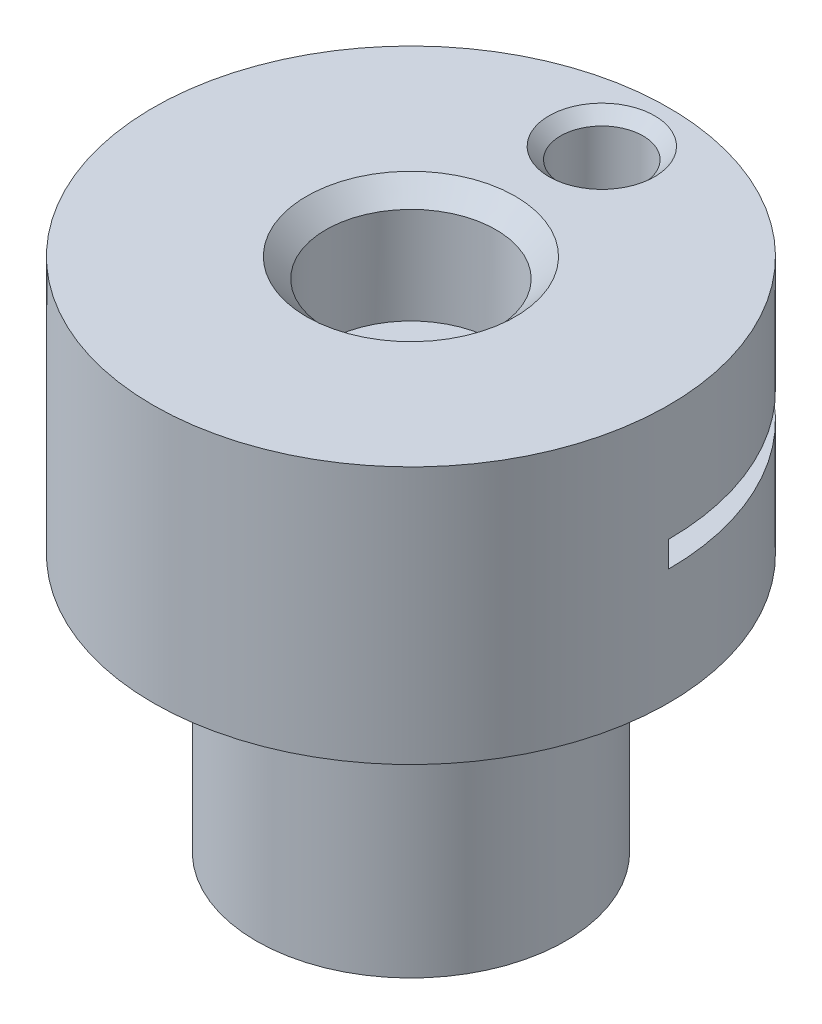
ISO-10303-21;
HEADER;
FILE_DESCRIPTION(('STEP AP214'),'2;1');
FILE_NAME('part.step','',(''),(''),'','','');
FILE_SCHEMA(('AUTOMOTIVE_DESIGN { 1 0 10303 214 1 1 1 1 }'));
ENDSEC;
DATA;
#1=APPLICATION_CONTEXT('core data for automotive mechanical design processes');
#2=APPLICATION_PROTOCOL_DEFINITION('international standard','automotive_design',2000,#1);
#3=PRODUCT_CONTEXT('',#1,'mechanical');
#4=PRODUCT('Part','Part','',(#3));
#5=PRODUCT_RELATED_PRODUCT_CATEGORY('part','',(#4));
#6=PRODUCT_DEFINITION_FORMATION('','',#4);
#7=PRODUCT_DEFINITION_CONTEXT('part definition',#1,'design');
#8=PRODUCT_DEFINITION('design','',#6,#7);
#9=PRODUCT_DEFINITION_SHAPE('','',#8);
#10=(LENGTH_UNIT() NAMED_UNIT(*) SI_UNIT(.MILLI.,.METRE.));
#11=(NAMED_UNIT(*) PLANE_ANGLE_UNIT() SI_UNIT($,.RADIAN.));
#12=(NAMED_UNIT(*) SI_UNIT($,.STERADIAN.) SOLID_ANGLE_UNIT());
#13=UNCERTAINTY_MEASURE_WITH_UNIT(LENGTH_MEASURE(1.E-05),#10,'distance_accuracy_value','');
#14=(GEOMETRIC_REPRESENTATION_CONTEXT(3) GLOBAL_UNCERTAINTY_ASSIGNED_CONTEXT((#13)) GLOBAL_UNIT_ASSIGNED_CONTEXT((#10,
#11,#12)) REPRESENTATION_CONTEXT('',''));
#15=CARTESIAN_POINT('',(0.,0.,0.));
#16=DIRECTION('',(0.,0.,1.));
#17=DIRECTION('',(1.,0.,0.));
#18=AXIS2_PLACEMENT_3D('',#15,#16,#17);
#19=CARTESIAN_POINT('',(0.000112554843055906,10.,-3.70259777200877));
#20=DIRECTION('',(0.,1.,0.));
#21=DIRECTION('',(0.,0.,1.));
#22=AXIS2_PLACEMENT_3D('',#19,#20,#21);
#23=CYLINDRICAL_SURFACE('',#22,0.799999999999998);
#24=CARTESIAN_POINT('',(0.000112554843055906,7.75,-3.70259777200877));
#25=DIRECTION('',(0.,1.,0.));
#26=DIRECTION('',(-1.,0.,0.));
#27=AXIS2_PLACEMENT_3D('',#24,#25,#26);
#28=CIRCLE('',#27,0.799999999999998);
#29=CARTESIAN_POINT('',(-0.799887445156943,7.75,-3.70259777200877));
#30=VERTEX_POINT('',#29);
#31=EDGE_CURVE('E108',#30,#30,#28,.F.);
#32=ORIENTED_EDGE('',*,*,#31,.T.);
#33=EDGE_LOOP('',(#32));
#34=FACE_BOUND('',#33,.T.);
#35=CARTESIAN_POINT('',(0.000112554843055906,9.775,-3.70259777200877));
#36=DIRECTION('',(0.,1.,0.));
#37=DIRECTION('',(0.,0.,1.));
#38=AXIS2_PLACEMENT_3D('',#35,#36,#37);
#39=CIRCLE('',#38,0.799999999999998);
#40=CARTESIAN_POINT('',(0.000112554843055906,9.775,-2.90259777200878));
#41=VERTEX_POINT('',#40);
#42=EDGE_CURVE('E124',#41,#41,#39,.T.);
#43=ORIENTED_EDGE('',*,*,#42,.T.);
#44=EDGE_LOOP('',(#43));
#45=FACE_BOUND('',#44,.T.);
#46=ADVANCED_FACE('F44',(#34,#45),#23,.F.);
#47=CARTESIAN_POINT('',(0.,0.,0.));
#48=DIRECTION('',(0.,-1.,0.));
#49=DIRECTION('',(0.,0.,-1.));
#50=AXIS2_PLACEMENT_3D('',#47,#48,#49);
#51=PLANE('',#50);
#52=CARTESIAN_POINT('',(0.000258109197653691,0.,0.000184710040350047));
#53=DIRECTION('',(0.,1.,0.));
#54=DIRECTION('',(0.,0.,1.));
#55=AXIS2_PLACEMENT_3D('',#52,#53,#54);
#56=CIRCLE('',#55,1.65);
#57=CARTESIAN_POINT('',(0.000258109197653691,0.,1.65018471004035));
#58=VERTEX_POINT('',#57);
#59=EDGE_CURVE('E137',#58,#58,#56,.T.);
#60=ORIENTED_EDGE('',*,*,#59,.T.);
#61=EDGE_LOOP('',(#60));
#62=FACE_BOUND('',#61,.T.);
#63=CARTESIAN_POINT('',(0.,0.,0.));
#64=DIRECTION('',(0.,1.,0.));
#65=DIRECTION('',(0.,0.,1.));
#66=AXIS2_PLACEMENT_3D('',#63,#64,#65);
#67=CIRCLE('',#66,3.);
#68=CARTESIAN_POINT('',(0.,0.,3.));
#69=VERTEX_POINT('',#68);
#70=EDGE_CURVE('E150',#69,#69,#67,.T.);
#71=ORIENTED_EDGE('',*,*,#70,.F.);
#72=EDGE_LOOP('',(#71));
#73=FACE_BOUND('',#72,.T.);
#74=ADVANCED_FACE('F46',(#62,#73),#51,.T.);
#75=CARTESIAN_POINT('',(0.,12.8085871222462,0.));
#76=DIRECTION('',(0.,1.,0.));
#77=DIRECTION('',(0.,0.,1.));
#78=AXIS2_PLACEMENT_3D('',#75,#76,#77);
#79=CYLINDRICAL_SURFACE('',#78,3.);
#80=ORIENTED_EDGE('',*,*,#70,.T.);
#81=EDGE_LOOP('',(#80));
#82=FACE_BOUND('',#81,.T.);
#83=CARTESIAN_POINT('',(0.,5.,0.));
#84=DIRECTION('',(0.,1.,0.));
#85=DIRECTION('',(0.,0.,1.));
#86=AXIS2_PLACEMENT_3D('',#83,#84,#85);
#87=CIRCLE('',#86,3.);
#88=CARTESIAN_POINT('',(0.343883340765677,5.,-2.98022553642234));
#89=VERTEX_POINT('',#88);
#90=CARTESIAN_POINT('',(-0.343702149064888,5.,-2.98024643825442));
#91=VERTEX_POINT('',#90);
#92=EDGE_CURVE('E147',#89,#91,#87,.T.);
#93=ORIENTED_EDGE('',*,*,#92,.F.);
#94=EDGE_CURVE('E146',#91,#89,#87,.T.);
#95=ORIENTED_EDGE('',*,*,#94,.F.);
#96=EDGE_LOOP('',(#93,#95));
#97=FACE_BOUND('',#96,.T.);
#98=ADVANCED_FACE('F177',(#82,#97),#79,.T.);
#99=CARTESIAN_POINT('',(-3.,5.,0.));
#100=DIRECTION('',(0.,-1.,0.));
#101=DIRECTION('',(0.,0.,-1.));
#102=AXIS2_PLACEMENT_3D('',#99,#100,#101);
#103=PLANE('',#102);
#104=CARTESIAN_POINT('',(0.000112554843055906,5.,-3.70259777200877));
#105=DIRECTION('',(0.,-1.,0.));
#106=DIRECTION('',(0.,0.,-1.));
#107=AXIS2_PLACEMENT_3D('',#104,#105,#106);
#108=CIRCLE('',#107,0.799999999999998);
#109=EDGE_CURVE('E92',#91,#89,#108,.T.);
#110=ORIENTED_EDGE('',*,*,#109,.F.);
#111=ORIENTED_EDGE('',*,*,#94,.T.);
#112=EDGE_LOOP('',(#110,#111));
#113=FACE_BOUND('',#112,.T.);
#114=CARTESIAN_POINT('',(0.,5.,0.));
#115=DIRECTION('',(0.,1.,0.));
#116=DIRECTION('',(0.,0.,1.));
#117=AXIS2_PLACEMENT_3D('',#114,#115,#116);
#118=CIRCLE('',#117,5.);
#119=CARTESIAN_POINT('',(0.,5.,5.));
#120=VERTEX_POINT('',#119);
#121=EDGE_CURVE('E143',#120,#120,#118,.T.);
#122=ORIENTED_EDGE('',*,*,#121,.F.);
#123=EDGE_LOOP('',(#122));
#124=FACE_BOUND('',#123,.T.);
#125=ADVANCED_FACE('F200',(#113,#124),#103,.T.);
#126=CARTESIAN_POINT('',(0.,12.8085871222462,0.));
#127=DIRECTION('',(0.,1.,0.));
#128=DIRECTION('',(0.,0.,1.));
#129=AXIS2_PLACEMENT_3D('',#126,#127,#128);
#130=CYLINDRICAL_SURFACE('',#129,5.);
#131=DIRECTION('',(0.,1.,0.));
#132=VECTOR('',#131,1.);
#133=CARTESIAN_POINT('',(5.,12.8085871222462,0.));
#134=LINE('',#133,#132);
#135=CARTESIAN_POINT('',(5.,7.75,0.));
#136=VERTEX_POINT('',#135);
#137=CARTESIAN_POINT('',(5.,7.25,0.));
#138=VERTEX_POINT('',#137);
#139=EDGE_CURVE('E121',#136,#138,#134,.F.);
#140=ORIENTED_EDGE('',*,*,#139,.F.);
#141=CARTESIAN_POINT('',(0.,7.75,0.));
#142=DIRECTION('',(0.,1.,0.));
#143=DIRECTION('',(-1.,0.,0.));
#144=AXIS2_PLACEMENT_3D('',#141,#142,#143);
#145=CIRCLE('',#144,5.);
#146=CARTESIAN_POINT('',(-5.,7.75,0.));
#147=VERTEX_POINT('',#146);
#148=EDGE_CURVE('E117',#147,#136,#145,.F.);
#149=ORIENTED_EDGE('',*,*,#148,.F.);
#150=DIRECTION('',(0.,1.,0.));
#151=VECTOR('',#150,1.);
#152=CARTESIAN_POINT('',(-5.,12.8085871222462,0.));
#153=LINE('',#152,#151);
#154=CARTESIAN_POINT('',(-5.,7.25,0.));
#155=VERTEX_POINT('',#154);
#156=EDGE_CURVE('E119',#155,#147,#153,.T.);
#157=ORIENTED_EDGE('',*,*,#156,.F.);
#158=CARTESIAN_POINT('',(0.,7.25,0.));
#159=DIRECTION('',(0.,-1.,0.));
#160=DIRECTION('',(1.,0.,0.));
#161=AXIS2_PLACEMENT_3D('',#158,#159,#160);
#162=CIRCLE('',#161,5.);
#163=EDGE_CURVE('E100',#138,#155,#162,.F.);
#164=ORIENTED_EDGE('',*,*,#163,.F.);
#165=EDGE_LOOP('',(#140,#149,#157,#164));
#166=FACE_BOUND('',#165,.T.);
#167=ORIENTED_EDGE('',*,*,#121,.T.);
#168=EDGE_LOOP('',(#167));
#169=FACE_BOUND('',#168,.T.);
#170=CARTESIAN_POINT('',(0.,10.,0.));
#171=DIRECTION('',(0.,1.,0.));
#172=DIRECTION('',(0.,0.,1.));
#173=AXIS2_PLACEMENT_3D('',#170,#171,#172);
#174=CIRCLE('',#173,5.);
#175=CARTESIAN_POINT('',(0.,10.,5.));
#176=VERTEX_POINT('',#175);
#177=EDGE_CURVE('E140',#176,#176,#174,.T.);
#178=ORIENTED_EDGE('',*,*,#177,.F.);
#179=EDGE_LOOP('',(#178));
#180=FACE_BOUND('',#179,.T.);
#181=ADVANCED_FACE('F215',(#166,#169,#180),#130,.T.);
#182=CARTESIAN_POINT('',(-5.,10.,0.));
#183=DIRECTION('',(0.,1.,0.));
#184=DIRECTION('',(0.,0.,1.));
#185=AXIS2_PLACEMENT_3D('',#182,#183,#184);
#186=PLANE('',#185);
#187=CARTESIAN_POINT('',(0.000112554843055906,10.,-3.70259777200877));
#188=DIRECTION('',(0.,1.,0.));
#189=DIRECTION('',(0.,0.,1.));
#190=AXIS2_PLACEMENT_3D('',#187,#188,#189);
#191=CIRCLE('',#190,1.025);
#192=CARTESIAN_POINT('',(0.000112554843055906,10.,-2.67759777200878));
#193=VERTEX_POINT('',#192);
#194=EDGE_CURVE('E128',#193,#193,#191,.T.);
#195=ORIENTED_EDGE('',*,*,#194,.F.);
#196=EDGE_LOOP('',(#195));
#197=FACE_BOUND('',#196,.T.);
#198=CARTESIAN_POINT('',(0.000258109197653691,10.,0.000184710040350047));
#199=DIRECTION('',(0.,1.,0.));
#200=DIRECTION('',(0.,0.,1.));
#201=AXIS2_PLACEMENT_3D('',#198,#199,#200);
#202=CIRCLE('',#201,2.025);
#203=CARTESIAN_POINT('',(0.000258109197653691,10.,2.02518471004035));
#204=VERTEX_POINT('',#203);
#205=EDGE_CURVE('E127',#204,#204,#202,.T.);
#206=ORIENTED_EDGE('',*,*,#205,.F.);
#207=EDGE_LOOP('',(#206));
#208=FACE_BOUND('',#207,.T.);
#209=ORIENTED_EDGE('',*,*,#177,.T.);
#210=EDGE_LOOP('',(#209));
#211=FACE_BOUND('',#210,.T.);
#212=ADVANCED_FACE('F212',(#197,#208,#211),#186,.T.);
#213=CARTESIAN_POINT('',(0.000258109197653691,10.,0.000184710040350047));
#214=DIRECTION('',(0.,1.,0.));
#215=DIRECTION('',(0.,0.,1.));
#216=AXIS2_PLACEMENT_3D('',#213,#214,#215);
#217=CYLINDRICAL_SURFACE('',#216,1.65);
#218=CARTESIAN_POINT('',(0.000258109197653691,7.75,0.000184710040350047));
#219=DIRECTION('',(0.,1.,0.));
#220=DIRECTION('',(-1.,0.,0.));
#221=AXIS2_PLACEMENT_3D('',#218,#219,#220);
#222=CIRCLE('',#221,1.65);
#223=CARTESIAN_POINT('',(-1.64974188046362,7.75,0.));
#224=VERTEX_POINT('',#223);
#225=CARTESIAN_POINT('',(1.65025809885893,7.75,0.));
#226=VERTEX_POINT('',#225);
#227=EDGE_CURVE('E115',#224,#226,#222,.F.);
#228=ORIENTED_EDGE('',*,*,#227,.T.);
#229=DIRECTION('',(0.,1.,0.));
#230=VECTOR('',#229,1.);
#231=CARTESIAN_POINT('',(1.65025809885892,10.,0.));
#232=LINE('',#231,#230);
#233=CARTESIAN_POINT('',(1.65025809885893,7.25,0.));
#234=VERTEX_POINT('',#233);
#235=EDGE_CURVE('E11',#226,#234,#232,.F.);
#236=ORIENTED_EDGE('',*,*,#235,.T.);
#237=CARTESIAN_POINT('',(0.000258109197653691,7.25,0.000184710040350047));
#238=DIRECTION('',(0.,-1.,0.));
#239=DIRECTION('',(1.,0.,0.));
#240=AXIS2_PLACEMENT_3D('',#237,#238,#239);
#241=CIRCLE('',#240,1.65);
#242=CARTESIAN_POINT('',(-1.64974188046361,7.25,0.));
#243=VERTEX_POINT('',#242);
#244=EDGE_CURVE('E97',#234,#243,#241,.F.);
#245=ORIENTED_EDGE('',*,*,#244,.T.);
#246=DIRECTION('',(0.,1.,0.));
#247=VECTOR('',#246,1.);
#248=CARTESIAN_POINT('',(-1.64974188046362,10.,0.));
#249=LINE('',#248,#247);
#250=EDGE_CURVE('E52',#243,#224,#249,.T.);
#251=ORIENTED_EDGE('',*,*,#250,.T.);
#252=EDGE_LOOP('',(#228,#236,#245,#251));
#253=FACE_BOUND('',#252,.T.);
#254=ORIENTED_EDGE('',*,*,#59,.F.);
#255=EDGE_LOOP('',(#254));
#256=FACE_BOUND('',#255,.T.);
#257=CARTESIAN_POINT('',(0.000258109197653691,9.625,0.000184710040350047));
#258=DIRECTION('',(0.,1.,0.));
#259=DIRECTION('',(0.,0.,1.));
#260=AXIS2_PLACEMENT_3D('',#257,#258,#259);
#261=CIRCLE('',#260,1.65);
#262=CARTESIAN_POINT('',(0.000258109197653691,9.625,1.65018471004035));
#263=VERTEX_POINT('',#262);
#264=EDGE_CURVE('E134',#263,#263,#261,.T.);
#265=ORIENTED_EDGE('',*,*,#264,.T.);
#266=EDGE_LOOP('',(#265));
#267=FACE_BOUND('',#266,.T.);
#268=ADVANCED_FACE('F104',(#253,#256,#267),#217,.F.);
#269=CARTESIAN_POINT('',(0.000258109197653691,10.,0.000184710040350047));
#270=DIRECTION('',(0.,1.,0.));
#271=DIRECTION('',(0.,0.,1.));
#272=AXIS2_PLACEMENT_3D('',#269,#270,#271);
#273=CONICAL_SURFACE('',#272,2.025,0.785398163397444);
#274=ORIENTED_EDGE('',*,*,#264,.F.);
#275=EDGE_LOOP('',(#274));
#276=FACE_BOUND('',#275,.T.);
#277=ORIENTED_EDGE('',*,*,#205,.T.);
#278=EDGE_LOOP('',(#277));
#279=FACE_BOUND('',#278,.T.);
#280=ADVANCED_FACE('F183',(#276,#279),#273,.F.);
#281=CARTESIAN_POINT('',(0.000112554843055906,7.25,-3.70259777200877));
#282=DIRECTION('',(0.,-1.,0.));
#283=DIRECTION('',(1.,0.,0.));
#284=AXIS2_PLACEMENT_3D('',#281,#282,#283);
#285=CIRCLE('',#284,0.799999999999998);
#286=CARTESIAN_POINT('',(0.800112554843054,7.25,-3.70259777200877));
#287=VERTEX_POINT('',#286);
#288=EDGE_CURVE('E106',#287,#287,#285,.F.);
#289=ORIENTED_EDGE('',*,*,#288,.T.);
#290=EDGE_LOOP('',(#289));
#291=FACE_BOUND('',#290,.T.);
#292=ORIENTED_EDGE('',*,*,#109,.T.);
#293=CARTESIAN_POINT('',(0.000112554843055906,5.,-3.70259777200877));
#294=DIRECTION('',(0.,-1.,0.));
#295=DIRECTION('',(0.,0.,-1.));
#296=AXIS2_PLACEMENT_3D('',#293,#294,#295);
#297=CIRCLE('',#296,0.799999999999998);
#298=EDGE_CURVE('E123',#91,#89,#297,.F.);
#299=ORIENTED_EDGE('',*,*,#298,.F.);
#300=EDGE_LOOP('',(#292,#299));
#301=FACE_BOUND('',#300,.T.);
#302=ADVANCED_FACE('F173',(#291,#301),#23,.F.);
#303=CARTESIAN_POINT('',(0.000112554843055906,10.,-3.70259777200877));
#304=DIRECTION('',(0.,1.,0.));
#305=DIRECTION('',(0.,0.,1.));
#306=AXIS2_PLACEMENT_3D('',#303,#304,#305);
#307=CONICAL_SURFACE('',#306,1.025,0.785398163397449);
#308=ORIENTED_EDGE('',*,*,#42,.F.);
#309=EDGE_LOOP('',(#308));
#310=FACE_BOUND('',#309,.T.);
#311=ORIENTED_EDGE('',*,*,#194,.T.);
#312=EDGE_LOOP('',(#311));
#313=FACE_BOUND('',#312,.T.);
#314=ADVANCED_FACE('F182',(#310,#313),#307,.F.);
#315=CARTESIAN_POINT('',(-3.,5.,0.));
#316=DIRECTION('',(0.,-1.,0.));
#317=DIRECTION('',(0.,0.,-1.));
#318=AXIS2_PLACEMENT_3D('',#315,#316,#317);
#319=PLANE('',#318);
#320=ORIENTED_EDGE('',*,*,#92,.T.);
#321=ORIENTED_EDGE('',*,*,#298,.T.);
#322=EDGE_LOOP('',(#320,#321));
#323=FACE_BOUND('',#322,.T.);
#324=ADVANCED_FACE('F189',(#323),#319,.F.);
#325=CARTESIAN_POINT('',(0.,0.,0.));
#326=DIRECTION('',(0.,0.,1.));
#327=DIRECTION('',(1.,0.,0.));
#328=AXIS2_PLACEMENT_3D('',#325,#326,#327);
#329=PLANE('',#328);
#330=ORIENTED_EDGE('',*,*,#139,.T.);
#331=DIRECTION('',(1.,0.,0.));
#332=VECTOR('',#331,1.);
#333=CARTESIAN_POINT('',(7.07280011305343,7.25,0.));
#334=LINE('',#333,#332);
#335=EDGE_CURVE('E102',#234,#138,#334,.T.);
#336=ORIENTED_EDGE('',*,*,#335,.F.);
#337=ORIENTED_EDGE('',*,*,#235,.F.);
#338=DIRECTION('',(-1.,0.,0.));
#339=VECTOR('',#338,1.);
#340=CARTESIAN_POINT('',(7.07280011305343,7.75,0.));
#341=LINE('',#340,#339);
#342=EDGE_CURVE('E111',#136,#226,#341,.T.);
#343=ORIENTED_EDGE('',*,*,#342,.F.);
#344=EDGE_LOOP('',(#330,#336,#337,#343));
#345=FACE_BOUND('',#344,.T.);
#346=ADVANCED_FACE('F169',(#345),#329,.F.);
#347=ORIENTED_EDGE('',*,*,#156,.T.);
#348=EDGE_CURVE('E64',#224,#147,#341,.T.);
#349=ORIENTED_EDGE('',*,*,#348,.F.);
#350=ORIENTED_EDGE('',*,*,#250,.F.);
#351=EDGE_CURVE('E59',#155,#243,#334,.T.);
#352=ORIENTED_EDGE('',*,*,#351,.F.);
#353=EDGE_LOOP('',(#347,#349,#350,#352));
#354=FACE_BOUND('',#353,.T.);
#355=ADVANCED_FACE('F88',(#354),#329,.F.);
#356=CARTESIAN_POINT('',(7.07280011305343,7.75,-10.));
#357=DIRECTION('',(0.,1.,0.));
#358=DIRECTION('',(-1.,0.,0.));
#359=AXIS2_PLACEMENT_3D('',#356,#357,#358);
#360=PLANE('',#359);
#361=ORIENTED_EDGE('',*,*,#148,.T.);
#362=ORIENTED_EDGE('',*,*,#342,.T.);
#363=ORIENTED_EDGE('',*,*,#227,.F.);
#364=ORIENTED_EDGE('',*,*,#348,.T.);
#365=EDGE_LOOP('',(#361,#362,#363,#364));
#366=FACE_BOUND('',#365,.T.);
#367=ORIENTED_EDGE('',*,*,#31,.F.);
#368=EDGE_LOOP('',(#367));
#369=FACE_BOUND('',#368,.T.);
#370=ADVANCED_FACE('F160',(#366,#369),#360,.F.);
#371=CARTESIAN_POINT('',(7.07280011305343,7.25,-10.));
#372=DIRECTION('',(0.,-1.,0.));
#373=DIRECTION('',(1.,0.,0.));
#374=AXIS2_PLACEMENT_3D('',#371,#372,#373);
#375=PLANE('',#374);
#376=ORIENTED_EDGE('',*,*,#163,.T.);
#377=ORIENTED_EDGE('',*,*,#351,.T.);
#378=ORIENTED_EDGE('',*,*,#244,.F.);
#379=ORIENTED_EDGE('',*,*,#335,.T.);
#380=EDGE_LOOP('',(#376,#377,#378,#379));
#381=FACE_BOUND('',#380,.T.);
#382=ORIENTED_EDGE('',*,*,#288,.F.);
#383=EDGE_LOOP('',(#382));
#384=FACE_BOUND('',#383,.T.);
#385=ADVANCED_FACE('F94',(#381,#384),#375,.F.);
#386=CLOSED_SHELL('',(#46,#74,#98,#125,#181,#212,#268,#280,#302,#314,#324,#346,#355,#370,#385));
#387=MANIFOLD_SOLID_BREP('B2',#386);
#388=ADVANCED_BREP_SHAPE_REPRESENTATION('',(#18,#387),#14);
#389=SHAPE_DEFINITION_REPRESENTATION(#9,#388);
ENDSEC;
END-ISO-10303-21;
